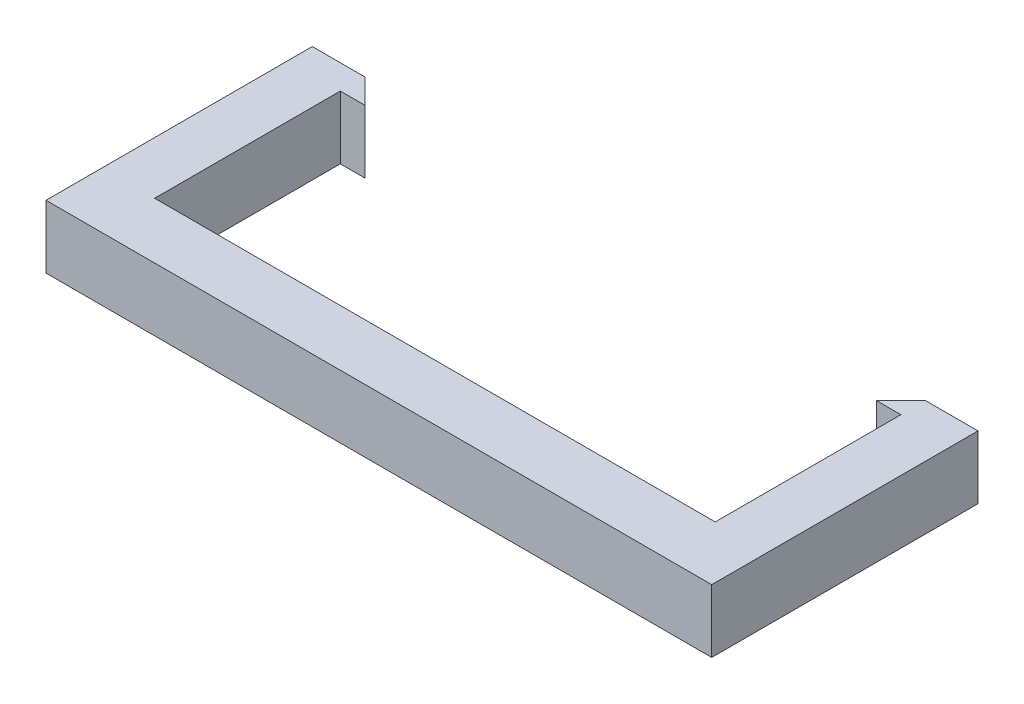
ISO-10303-21;
HEADER;
FILE_DESCRIPTION(('STEP AP214'),'2;1');
FILE_NAME('part.step','',(''),(''),'','','');
FILE_SCHEMA(('AUTOMOTIVE_DESIGN { 1 0 10303 214 1 1 1 1 }'));
ENDSEC;
DATA;
#1=APPLICATION_CONTEXT('core data for automotive mechanical design processes');
#2=APPLICATION_PROTOCOL_DEFINITION('international standard','automotive_design',2000,#1);
#3=PRODUCT_CONTEXT('',#1,'mechanical');
#4=PRODUCT('Part','Part','',(#3));
#5=PRODUCT_RELATED_PRODUCT_CATEGORY('part','',(#4));
#6=PRODUCT_DEFINITION_FORMATION('','',#4);
#7=PRODUCT_DEFINITION_CONTEXT('part definition',#1,'design');
#8=PRODUCT_DEFINITION('design','',#6,#7);
#9=PRODUCT_DEFINITION_SHAPE('','',#8);
#10=(LENGTH_UNIT() NAMED_UNIT(*) SI_UNIT(.MILLI.,.METRE.));
#11=(NAMED_UNIT(*) PLANE_ANGLE_UNIT() SI_UNIT($,.RADIAN.));
#12=(NAMED_UNIT(*) SI_UNIT($,.STERADIAN.) SOLID_ANGLE_UNIT());
#13=UNCERTAINTY_MEASURE_WITH_UNIT(LENGTH_MEASURE(1.E-05),#10,'distance_accuracy_value','');
#14=(GEOMETRIC_REPRESENTATION_CONTEXT(3) GLOBAL_UNCERTAINTY_ASSIGNED_CONTEXT((#13)) GLOBAL_UNIT_ASSIGNED_CONTEXT((#10,
#11,#12)) REPRESENTATION_CONTEXT('',''));
#15=CARTESIAN_POINT('',(0.,0.,0.));
#16=DIRECTION('',(0.,0.,1.));
#17=DIRECTION('',(1.,0.,0.));
#18=AXIS2_PLACEMENT_3D('',#15,#16,#17);
#19=CARTESIAN_POINT('',(37.7790702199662,3.23798646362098,-30.));
#20=DIRECTION('',(1.,0.,0.));
#21=DIRECTION('',(0.,0.,-1.));
#22=AXIS2_PLACEMENT_3D('',#19,#20,#21);
#23=PLANE('',#22);
#24=DIRECTION('',(0.,1.,0.));
#25=VECTOR('',#24,1.);
#26=CARTESIAN_POINT('',(37.7790702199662,3.23798646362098,-26.5));
#27=LINE('',#26,#25);
#28=CARTESIAN_POINT('',(37.7790702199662,3.23798646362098,-26.5));
#29=VERTEX_POINT('',#28);
#30=CARTESIAN_POINT('',(37.7790702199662,12.237986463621,-26.5));
#31=VERTEX_POINT('',#30);
#32=EDGE_CURVE('E126',#29,#31,#27,.T.);
#33=ORIENTED_EDGE('',*,*,#32,.F.);
#34=DIRECTION('',(0.,0.,1.));
#35=VECTOR('',#34,1.);
#36=CARTESIAN_POINT('',(37.7790702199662,3.23798646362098,-30.));
#37=LINE('',#36,#35);
#38=CARTESIAN_POINT('',(37.7790702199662,3.23798646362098,0.));
#39=VERTEX_POINT('',#38);
#40=EDGE_CURVE('E135',#29,#39,#37,.T.);
#41=ORIENTED_EDGE('',*,*,#40,.T.);
#42=DIRECTION('',(0.,1.,0.));
#43=VECTOR('',#42,1.);
#44=CARTESIAN_POINT('',(37.7790702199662,3.23798646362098,0.));
#45=LINE('',#44,#43);
#46=CARTESIAN_POINT('',(37.7790702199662,12.237986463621,0.));
#47=VERTEX_POINT('',#46);
#48=EDGE_CURVE('E205',#39,#47,#45,.T.);
#49=ORIENTED_EDGE('',*,*,#48,.T.);
#50=DIRECTION('',(0.,0.,1.));
#51=VECTOR('',#50,1.);
#52=CARTESIAN_POINT('',(37.7790702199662,12.237986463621,-30.));
#53=LINE('',#52,#51);
#54=EDGE_CURVE('E137',#31,#47,#53,.T.);
#55=ORIENTED_EDGE('',*,*,#54,.F.);
#56=EDGE_LOOP('',(#33,#41,#49,#55));
#57=FACE_BOUND('',#56,.T.);
#58=ADVANCED_FACE('F33',(#57),#23,.F.);
#59=CARTESIAN_POINT('',(-42.2209297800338,3.23798646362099,-30.));
#60=DIRECTION('',(-1.,0.,0.));
#61=DIRECTION('',(0.,-1.,0.));
#62=AXIS2_PLACEMENT_3D('',#59,#60,#61);
#63=PLANE('',#62);
#64=DIRECTION('',(0.,-1.,0.));
#65=VECTOR('',#64,1.);
#66=CARTESIAN_POINT('',(-42.2209297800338,3.237986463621,-26.5));
#67=LINE('',#66,#65);
#68=CARTESIAN_POINT('',(-42.2209297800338,12.237986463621,-26.5));
#69=VERTEX_POINT('',#68);
#70=CARTESIAN_POINT('',(-42.2209297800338,3.237986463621,-26.5));
#71=VERTEX_POINT('',#70);
#72=EDGE_CURVE('E130',#69,#71,#67,.T.);
#73=ORIENTED_EDGE('',*,*,#72,.F.);
#74=DIRECTION('',(0.,0.,1.));
#75=VECTOR('',#74,1.);
#76=CARTESIAN_POINT('',(-42.2209297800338,12.237986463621,-30.));
#77=LINE('',#76,#75);
#78=CARTESIAN_POINT('',(-42.2209297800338,12.237986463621,0.));
#79=VERTEX_POINT('',#78);
#80=EDGE_CURVE('E174',#69,#79,#77,.T.);
#81=ORIENTED_EDGE('',*,*,#80,.T.);
#82=DIRECTION('',(0.,-1.,0.));
#83=VECTOR('',#82,1.);
#84=CARTESIAN_POINT('',(-42.2209297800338,3.23798646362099,0.));
#85=LINE('',#84,#83);
#86=CARTESIAN_POINT('',(-42.2209297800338,3.23798646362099,0.));
#87=VERTEX_POINT('',#86);
#88=EDGE_CURVE('E143',#79,#87,#85,.T.);
#89=ORIENTED_EDGE('',*,*,#88,.T.);
#90=DIRECTION('',(0.,0.,1.));
#91=VECTOR('',#90,1.);
#92=CARTESIAN_POINT('',(-42.2209297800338,3.23798646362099,-30.));
#93=LINE('',#92,#91);
#94=EDGE_CURVE('E159',#71,#87,#93,.T.);
#95=ORIENTED_EDGE('',*,*,#94,.F.);
#96=EDGE_LOOP('',(#73,#81,#89,#95));
#97=FACE_BOUND('',#96,.T.);
#98=ADVANCED_FACE('F225',(#97),#63,.F.);
#99=CARTESIAN_POINT('',(0.,0.,0.));
#100=DIRECTION('',(0.,0.,1.));
#101=DIRECTION('',(1.,0.,0.));
#102=AXIS2_PLACEMENT_3D('',#99,#100,#101);
#103=PLANE('',#102);
#104=ORIENTED_EDGE('',*,*,#48,.F.);
#105=DIRECTION('',(1.,0.,0.));
#106=VECTOR('',#105,1.);
#107=CARTESIAN_POINT('',(-49.7209297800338,3.23798646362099,0.));
#108=LINE('',#107,#106);
#109=EDGE_CURVE('E142',#87,#39,#108,.T.);
#110=ORIENTED_EDGE('',*,*,#109,.F.);
#111=ORIENTED_EDGE('',*,*,#88,.F.);
#112=DIRECTION('',(-1.,0.,0.));
#113=VECTOR('',#112,1.);
#114=CARTESIAN_POINT('',(-49.7209297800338,12.237986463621,0.));
#115=LINE('',#114,#113);
#116=EDGE_CURVE('E175',#47,#79,#115,.T.);
#117=ORIENTED_EDGE('',*,*,#116,.F.);
#118=EDGE_LOOP('',(#104,#110,#111,#117));
#119=FACE_BOUND('',#118,.T.);
#120=ADVANCED_FACE('F230',(#119),#103,.F.);
#121=CARTESIAN_POINT('',(-49.7209297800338,12.237986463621,8.));
#122=DIRECTION('',(1.,0.,0.));
#123=DIRECTION('',(0.,0.,-1.));
#124=AXIS2_PLACEMENT_3D('',#121,#122,#123);
#125=PLANE('',#124);
#126=DIRECTION('',(0.,0.,-1.));
#127=VECTOR('',#126,1.);
#128=CARTESIAN_POINT('',(-49.7209297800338,12.237986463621,8.));
#129=LINE('',#128,#127);
#130=CARTESIAN_POINT('',(-49.7209297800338,12.237986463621,8.));
#131=VERTEX_POINT('',#130);
#132=CARTESIAN_POINT('',(-49.7209297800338,12.237986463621,-30.));
#133=VERTEX_POINT('',#132);
#134=EDGE_CURVE('E263',#131,#133,#129,.T.);
#135=ORIENTED_EDGE('',*,*,#134,.T.);
#136=DIRECTION('',(0.,1.,0.));
#137=VECTOR('',#136,1.);
#138=CARTESIAN_POINT('',(-49.7209297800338,3.23798646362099,-30.));
#139=LINE('',#138,#137);
#140=CARTESIAN_POINT('',(-49.7209297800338,3.23798646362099,-30.));
#141=VERTEX_POINT('',#140);
#142=EDGE_CURVE('E146',#141,#133,#139,.T.);
#143=ORIENTED_EDGE('',*,*,#142,.F.);
#144=DIRECTION('',(0.,0.,-1.));
#145=VECTOR('',#144,1.);
#146=CARTESIAN_POINT('',(-49.7209297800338,3.23798646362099,8.));
#147=LINE('',#146,#145);
#148=CARTESIAN_POINT('',(-49.7209297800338,3.23798646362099,8.));
#149=VERTEX_POINT('',#148);
#150=EDGE_CURVE('E181',#149,#141,#147,.T.);
#151=ORIENTED_EDGE('',*,*,#150,.F.);
#152=DIRECTION('',(0.,-1.,0.));
#153=VECTOR('',#152,1.);
#154=CARTESIAN_POINT('',(-49.7209297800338,12.237986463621,8.));
#155=LINE('',#154,#153);
#156=EDGE_CURVE('E162',#131,#149,#155,.T.);
#157=ORIENTED_EDGE('',*,*,#156,.F.);
#158=EDGE_LOOP('',(#135,#143,#151,#157));
#159=FACE_BOUND('',#158,.T.);
#160=ADVANCED_FACE('F246',(#159),#125,.F.);
#161=CARTESIAN_POINT('',(-49.7209297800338,3.23798646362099,8.));
#162=DIRECTION('',(0.,1.,0.));
#163=DIRECTION('',(0.,0.,1.));
#164=AXIS2_PLACEMENT_3D('',#161,#162,#163);
#165=PLANE('',#164);
#166=DIRECTION('',(1.,0.,0.));
#167=VECTOR('',#166,1.);
#168=CARTESIAN_POINT('',(32.7790702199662,3.23798646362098,-26.5));
#169=LINE('',#168,#167);
#170=CARTESIAN_POINT('',(34.2790702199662,3.23798646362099,-26.5));
#171=VERTEX_POINT('',#170);
#172=EDGE_CURVE('E122',#171,#29,#169,.T.);
#173=ORIENTED_EDGE('',*,*,#172,.F.);
#174=DIRECTION('',(-0.707106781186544,0.,0.707106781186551));
#175=VECTOR('',#174,1.);
#176=CARTESIAN_POINT('',(32.7790702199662,3.23798646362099,-24.9999999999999));
#177=LINE('',#176,#175);
#178=CARTESIAN_POINT('',(37.7790702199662,3.23798646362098,-30.));
#179=VERTEX_POINT('',#178);
#180=EDGE_CURVE('E54',#171,#179,#177,.F.);
#181=ORIENTED_EDGE('',*,*,#180,.T.);
#182=DIRECTION('',(-1.,0.,0.));
#183=VECTOR('',#182,1.);
#184=CARTESIAN_POINT('',(45.2790702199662,3.23798646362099,-30.));
#185=LINE('',#184,#183);
#186=CARTESIAN_POINT('',(45.2790702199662,3.23798646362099,-30.));
#187=VERTEX_POINT('',#186);
#188=EDGE_CURVE('E194',#187,#179,#185,.T.);
#189=ORIENTED_EDGE('',*,*,#188,.F.);
#190=DIRECTION('',(0.,0.,-1.));
#191=VECTOR('',#190,1.);
#192=CARTESIAN_POINT('',(45.2790702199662,3.23798646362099,8.));
#193=LINE('',#192,#191);
#194=CARTESIAN_POINT('',(45.2790702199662,3.23798646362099,8.));
#195=VERTEX_POINT('',#194);
#196=EDGE_CURVE('E275',#195,#187,#193,.T.);
#197=ORIENTED_EDGE('',*,*,#196,.F.);
#198=DIRECTION('',(1.,0.,0.));
#199=VECTOR('',#198,1.);
#200=CARTESIAN_POINT('',(-49.7209297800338,3.23798646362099,8.));
#201=LINE('',#200,#199);
#202=EDGE_CURVE('E274',#149,#195,#201,.T.);
#203=ORIENTED_EDGE('',*,*,#202,.F.);
#204=ORIENTED_EDGE('',*,*,#150,.T.);
#205=DIRECTION('',(-1.,0.,0.));
#206=VECTOR('',#205,1.);
#207=CARTESIAN_POINT('',(-49.7209297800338,3.23798646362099,-30.));
#208=LINE('',#207,#206);
#209=CARTESIAN_POINT('',(-42.2209297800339,3.23798646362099,-30.));
#210=VERTEX_POINT('',#209);
#211=EDGE_CURVE('E157',#210,#141,#208,.T.);
#212=ORIENTED_EDGE('',*,*,#211,.F.);
#213=DIRECTION('',(-0.707106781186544,0.,-0.707106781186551));
#214=VECTOR('',#213,1.);
#215=CARTESIAN_POINT('',(-37.2209297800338,3.23798646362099,-24.9999999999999));
#216=LINE('',#215,#214);
#217=CARTESIAN_POINT('',(-38.7209297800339,3.23798646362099,-26.5));
#218=VERTEX_POINT('',#217);
#219=EDGE_CURVE('E186',#210,#218,#216,.F.);
#220=ORIENTED_EDGE('',*,*,#219,.T.);
#221=DIRECTION('',(-1.,0.,0.));
#222=VECTOR('',#221,1.);
#223=CARTESIAN_POINT('',(-37.2209297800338,3.23798646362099,-26.5));
#224=LINE('',#223,#222);
#225=EDGE_CURVE('E208',#218,#71,#224,.T.);
#226=ORIENTED_EDGE('',*,*,#225,.T.);
#227=ORIENTED_EDGE('',*,*,#94,.T.);
#228=ORIENTED_EDGE('',*,*,#109,.T.);
#229=ORIENTED_EDGE('',*,*,#40,.F.);
#230=EDGE_LOOP('',(#173,#181,#189,#197,#203,#204,#212,#220,#226,#227,#228,#229));
#231=FACE_BOUND('',#230,.T.);
#232=ADVANCED_FACE('F140',(#231),#165,.F.);
#233=CARTESIAN_POINT('',(45.2790702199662,12.237986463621,8.));
#234=DIRECTION('',(-1.,0.,0.));
#235=DIRECTION('',(0.,-1.,0.));
#236=AXIS2_PLACEMENT_3D('',#233,#234,#235);
#237=PLANE('',#236);
#238=ORIENTED_EDGE('',*,*,#196,.T.);
#239=DIRECTION('',(0.,-1.,0.));
#240=VECTOR('',#239,1.);
#241=CARTESIAN_POINT('',(45.2790702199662,3.23798646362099,-30.));
#242=LINE('',#241,#240);
#243=CARTESIAN_POINT('',(45.2790702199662,12.237986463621,-30.));
#244=VERTEX_POINT('',#243);
#245=EDGE_CURVE('E202',#244,#187,#242,.T.);
#246=ORIENTED_EDGE('',*,*,#245,.F.);
#247=DIRECTION('',(0.,0.,-1.));
#248=VECTOR('',#247,1.);
#249=CARTESIAN_POINT('',(45.2790702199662,12.237986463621,8.));
#250=LINE('',#249,#248);
#251=CARTESIAN_POINT('',(45.2790702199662,12.237986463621,8.));
#252=VERTEX_POINT('',#251);
#253=EDGE_CURVE('E199',#252,#244,#250,.T.);
#254=ORIENTED_EDGE('',*,*,#253,.F.);
#255=DIRECTION('',(0.,1.,0.));
#256=VECTOR('',#255,1.);
#257=CARTESIAN_POINT('',(45.2790702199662,12.237986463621,8.));
#258=LINE('',#257,#256);
#259=EDGE_CURVE('E282',#195,#252,#258,.T.);
#260=ORIENTED_EDGE('',*,*,#259,.F.);
#261=EDGE_LOOP('',(#238,#246,#254,#260));
#262=FACE_BOUND('',#261,.T.);
#263=ADVANCED_FACE('F250',(#262),#237,.F.);
#264=CARTESIAN_POINT('',(-49.7209297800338,12.237986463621,8.));
#265=DIRECTION('',(0.,-1.,0.));
#266=DIRECTION('',(0.,0.,-1.));
#267=AXIS2_PLACEMENT_3D('',#264,#265,#266);
#268=PLANE('',#267);
#269=DIRECTION('',(1.,0.,0.));
#270=VECTOR('',#269,1.);
#271=CARTESIAN_POINT('',(45.2790702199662,12.237986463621,-30.));
#272=LINE('',#271,#270);
#273=CARTESIAN_POINT('',(37.7790702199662,12.237986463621,-30.));
#274=VERTEX_POINT('',#273);
#275=EDGE_CURVE('E148',#274,#244,#272,.T.);
#276=ORIENTED_EDGE('',*,*,#275,.F.);
#277=DIRECTION('',(0.707106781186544,0.,-0.707106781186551));
#278=VECTOR('',#277,1.);
#279=CARTESIAN_POINT('',(32.7790702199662,12.237986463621,-24.9999999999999));
#280=LINE('',#279,#278);
#281=CARTESIAN_POINT('',(34.2790702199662,12.237986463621,-26.5));
#282=VERTEX_POINT('',#281);
#283=EDGE_CURVE('E11',#274,#282,#280,.F.);
#284=ORIENTED_EDGE('',*,*,#283,.T.);
#285=DIRECTION('',(1.,0.,0.));
#286=VECTOR('',#285,1.);
#287=CARTESIAN_POINT('',(32.7790702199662,12.237986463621,-26.5));
#288=LINE('',#287,#286);
#289=EDGE_CURVE('E131',#282,#31,#288,.T.);
#290=ORIENTED_EDGE('',*,*,#289,.T.);
#291=ORIENTED_EDGE('',*,*,#54,.T.);
#292=ORIENTED_EDGE('',*,*,#116,.T.);
#293=ORIENTED_EDGE('',*,*,#80,.F.);
#294=DIRECTION('',(-1.,0.,0.));
#295=VECTOR('',#294,1.);
#296=CARTESIAN_POINT('',(-37.2209297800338,12.237986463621,-26.5));
#297=LINE('',#296,#295);
#298=CARTESIAN_POINT('',(-38.7209297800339,12.237986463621,-26.5));
#299=VERTEX_POINT('',#298);
#300=EDGE_CURVE('E206',#299,#69,#297,.T.);
#301=ORIENTED_EDGE('',*,*,#300,.F.);
#302=DIRECTION('',(0.707106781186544,0.,0.707106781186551));
#303=VECTOR('',#302,1.);
#304=CARTESIAN_POINT('',(-37.2209297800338,12.237986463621,-24.9999999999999));
#305=LINE('',#304,#303);
#306=CARTESIAN_POINT('',(-42.2209297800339,12.237986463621,-30.));
#307=VERTEX_POINT('',#306);
#308=EDGE_CURVE('E180',#299,#307,#305,.F.);
#309=ORIENTED_EDGE('',*,*,#308,.T.);
#310=DIRECTION('',(1.,0.,0.));
#311=VECTOR('',#310,1.);
#312=CARTESIAN_POINT('',(-49.7209297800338,12.237986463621,-30.));
#313=LINE('',#312,#311);
#314=EDGE_CURVE('E154',#133,#307,#313,.T.);
#315=ORIENTED_EDGE('',*,*,#314,.F.);
#316=ORIENTED_EDGE('',*,*,#134,.F.);
#317=DIRECTION('',(-1.,0.,0.));
#318=VECTOR('',#317,1.);
#319=CARTESIAN_POINT('',(-49.7209297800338,12.237986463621,8.));
#320=LINE('',#319,#318);
#321=EDGE_CURVE('E267',#252,#131,#320,.T.);
#322=ORIENTED_EDGE('',*,*,#321,.F.);
#323=ORIENTED_EDGE('',*,*,#253,.T.);
#324=EDGE_LOOP('',(#276,#284,#290,#291,#292,#293,#301,#309,#315,#316,#322,#323));
#325=FACE_BOUND('',#324,.T.);
#326=ADVANCED_FACE('F196',(#325),#268,.F.);
#327=CARTESIAN_POINT('',(0.,0.,8.));
#328=DIRECTION('',(0.,0.,1.));
#329=DIRECTION('',(1.,0.,0.));
#330=AXIS2_PLACEMENT_3D('',#327,#328,#329);
#331=PLANE('',#330);
#332=ORIENTED_EDGE('',*,*,#156,.T.);
#333=ORIENTED_EDGE('',*,*,#202,.T.);
#334=ORIENTED_EDGE('',*,*,#259,.T.);
#335=ORIENTED_EDGE('',*,*,#321,.T.);
#336=EDGE_LOOP('',(#332,#333,#334,#335));
#337=FACE_BOUND('',#336,.T.);
#338=ADVANCED_FACE('F238',(#337),#331,.T.);
#339=CARTESIAN_POINT('',(0.,0.,-30.));
#340=DIRECTION('',(0.,0.,-1.));
#341=DIRECTION('',(-1.,0.,0.));
#342=AXIS2_PLACEMENT_3D('',#339,#340,#341);
#343=PLANE('',#342);
#344=ORIENTED_EDGE('',*,*,#314,.T.);
#345=DIRECTION('',(0.,-1.,0.));
#346=VECTOR('',#345,1.);
#347=CARTESIAN_POINT('',(-42.2209297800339,0.,-30.));
#348=LINE('',#347,#346);
#349=EDGE_CURVE('E183',#307,#210,#348,.T.);
#350=ORIENTED_EDGE('',*,*,#349,.T.);
#351=ORIENTED_EDGE('',*,*,#211,.T.);
#352=ORIENTED_EDGE('',*,*,#142,.T.);
#353=EDGE_LOOP('',(#344,#350,#351,#352));
#354=FACE_BOUND('',#353,.T.);
#355=ADVANCED_FACE('F236',(#354),#343,.T.);
#356=CARTESIAN_POINT('',(0.,0.,-30.));
#357=DIRECTION('',(0.,0.,1.));
#358=DIRECTION('',(1.,0.,0.));
#359=AXIS2_PLACEMENT_3D('',#356,#357,#358);
#360=PLANE('',#359);
#361=ORIENTED_EDGE('',*,*,#188,.T.);
#362=DIRECTION('',(0.,1.,0.));
#363=VECTOR('',#362,1.);
#364=CARTESIAN_POINT('',(37.7790702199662,0.,-30.));
#365=LINE('',#364,#363);
#366=EDGE_CURVE('E41',#179,#274,#365,.T.);
#367=ORIENTED_EDGE('',*,*,#366,.T.);
#368=ORIENTED_EDGE('',*,*,#275,.T.);
#369=ORIENTED_EDGE('',*,*,#245,.T.);
#370=EDGE_LOOP('',(#361,#367,#368,#369));
#371=FACE_BOUND('',#370,.T.);
#372=ADVANCED_FACE('F191',(#371),#360,.F.);
#373=CARTESIAN_POINT('',(-37.2209297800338,3.23798646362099,-26.5));
#374=DIRECTION('',(0.,0.,-1.));
#375=DIRECTION('',(-1.,0.,0.));
#376=AXIS2_PLACEMENT_3D('',#373,#374,#375);
#377=PLANE('',#376);
#378=ORIENTED_EDGE('',*,*,#225,.F.);
#379=DIRECTION('',(0.,-1.,0.));
#380=VECTOR('',#379,1.);
#381=CARTESIAN_POINT('',(-38.7209297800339,0.,-26.5));
#382=LINE('',#381,#380);
#383=EDGE_CURVE('E178',#218,#299,#382,.F.);
#384=ORIENTED_EDGE('',*,*,#383,.T.);
#385=ORIENTED_EDGE('',*,*,#300,.T.);
#386=ORIENTED_EDGE('',*,*,#72,.T.);
#387=EDGE_LOOP('',(#378,#384,#385,#386));
#388=FACE_BOUND('',#387,.T.);
#389=ADVANCED_FACE('F287',(#388),#377,.F.);
#390=CARTESIAN_POINT('',(32.7790702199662,3.23798646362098,-26.5));
#391=DIRECTION('',(0.,0.,-1.));
#392=DIRECTION('',(-1.,0.,0.));
#393=AXIS2_PLACEMENT_3D('',#390,#391,#392);
#394=PLANE('',#393);
#395=ORIENTED_EDGE('',*,*,#289,.F.);
#396=DIRECTION('',(0.,1.,0.));
#397=VECTOR('',#396,1.);
#398=CARTESIAN_POINT('',(34.2790702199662,0.,-26.5));
#399=LINE('',#398,#397);
#400=EDGE_CURVE('E128',#282,#171,#399,.F.);
#401=ORIENTED_EDGE('',*,*,#400,.T.);
#402=ORIENTED_EDGE('',*,*,#172,.T.);
#403=ORIENTED_EDGE('',*,*,#32,.T.);
#404=EDGE_LOOP('',(#395,#401,#402,#403));
#405=FACE_BOUND('',#404,.T.);
#406=ADVANCED_FACE('F125',(#405),#394,.F.);
#407=CARTESIAN_POINT('',(-37.2209297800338,0.,-24.9999999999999));
#408=DIRECTION('',(-0.707106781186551,0.,0.707106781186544));
#409=DIRECTION('',(0.,1.,0.));
#410=AXIS2_PLACEMENT_3D('',#407,#408,#409);
#411=PLANE('',#410);
#412=ORIENTED_EDGE('',*,*,#219,.F.);
#413=ORIENTED_EDGE('',*,*,#349,.F.);
#414=ORIENTED_EDGE('',*,*,#308,.F.);
#415=ORIENTED_EDGE('',*,*,#383,.F.);
#416=EDGE_LOOP('',(#412,#413,#414,#415));
#417=FACE_BOUND('',#416,.T.);
#418=ADVANCED_FACE('F219',(#417),#411,.F.);
#419=CARTESIAN_POINT('',(32.7790702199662,0.,-24.9999999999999));
#420=DIRECTION('',(0.707106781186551,0.,0.707106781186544));
#421=DIRECTION('',(0.,-1.,0.));
#422=AXIS2_PLACEMENT_3D('',#419,#420,#421);
#423=PLANE('',#422);
#424=ORIENTED_EDGE('',*,*,#283,.F.);
#425=ORIENTED_EDGE('',*,*,#366,.F.);
#426=ORIENTED_EDGE('',*,*,#180,.F.);
#427=ORIENTED_EDGE('',*,*,#400,.F.);
#428=EDGE_LOOP('',(#424,#425,#426,#427));
#429=FACE_BOUND('',#428,.T.);
#430=ADVANCED_FACE('F35',(#429),#423,.F.);
#431=CLOSED_SHELL('',(#58,#98,#120,#160,#232,#263,#326,#338,#355,#372,#389,#406,#418,#430));
#432=MANIFOLD_SOLID_BREP('B2',#431);
#433=ADVANCED_BREP_SHAPE_REPRESENTATION('',(#18,#432),#14);
#434=SHAPE_DEFINITION_REPRESENTATION(#9,#433);
ENDSEC;
END-ISO-10303-21;
